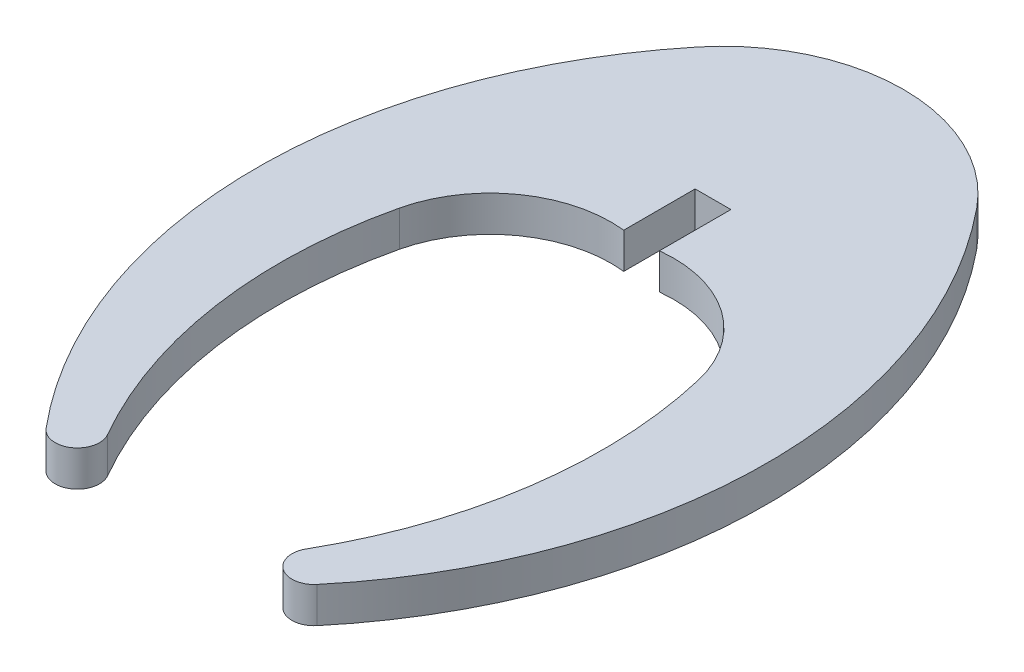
ISO-10303-21;
HEADER;
FILE_DESCRIPTION(('STEP AP214'),'2;1');
FILE_NAME('part.step','',(''),(''),'','','');
FILE_SCHEMA(('AUTOMOTIVE_DESIGN { 1 0 10303 214 1 1 1 1 }'));
ENDSEC;
DATA;
#1=APPLICATION_CONTEXT('core data for automotive mechanical design processes');
#2=APPLICATION_PROTOCOL_DEFINITION('international standard','automotive_design',2000,#1);
#3=PRODUCT_CONTEXT('',#1,'mechanical');
#4=PRODUCT('Part','Part','',(#3));
#5=PRODUCT_RELATED_PRODUCT_CATEGORY('part','',(#4));
#6=PRODUCT_DEFINITION_FORMATION('','',#4);
#7=PRODUCT_DEFINITION_CONTEXT('part definition',#1,'design');
#8=PRODUCT_DEFINITION('design','',#6,#7);
#9=PRODUCT_DEFINITION_SHAPE('','',#8);
#10=(LENGTH_UNIT() NAMED_UNIT(*) SI_UNIT(.MILLI.,.METRE.));
#11=(NAMED_UNIT(*) PLANE_ANGLE_UNIT() SI_UNIT($,.RADIAN.));
#12=(NAMED_UNIT(*) SI_UNIT($,.STERADIAN.) SOLID_ANGLE_UNIT());
#13=UNCERTAINTY_MEASURE_WITH_UNIT(LENGTH_MEASURE(1.E-05),#10,'distance_accuracy_value','');
#14=(GEOMETRIC_REPRESENTATION_CONTEXT(3) GLOBAL_UNCERTAINTY_ASSIGNED_CONTEXT((#13)) GLOBAL_UNIT_ASSIGNED_CONTEXT((#10,
#11,#12)) REPRESENTATION_CONTEXT('',''));
#15=CARTESIAN_POINT('',(0.,0.,0.));
#16=DIRECTION('',(0.,0.,1.));
#17=DIRECTION('',(1.,0.,0.));
#18=AXIS2_PLACEMENT_3D('',#15,#16,#17);
#19=CARTESIAN_POINT('',(-42034.834036,3.,-18212.047257));
#20=DIRECTION('',(0.999999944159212,0.,0.000334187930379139));
#21=DIRECTION('',(0.000334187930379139,0.,-0.999999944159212));
#22=AXIS2_PLACEMENT_3D('',#19,#20,#21);
#23=PLANE('',#22);
#24=DIRECTION('',(-0.000334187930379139,0.,0.999999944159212));
#25=VECTOR('',#24,1.);
#26=CARTESIAN_POINT('',(-42034.834036,0.,-18212.047257));
#27=LINE('',#26,#25);
#28=CARTESIAN_POINT('',(-42034.832031,0.,-18218.046875));
#29=VERTEX_POINT('',#28);
#30=CARTESIAN_POINT('',(-42034.834036,0.,-18212.047257));
#31=VERTEX_POINT('',#30);
#32=EDGE_CURVE('E156',#29,#31,#27,.T.);
#33=ORIENTED_EDGE('',*,*,#32,.T.);
#34=DIRECTION('',(0.,-1.,0.));
#35=VECTOR('',#34,1.);
#36=CARTESIAN_POINT('',(-42034.834036,3.,-18212.047257));
#37=LINE('',#36,#35);
#38=CARTESIAN_POINT('',(-42034.834036,3.,-18212.047257));
#39=VERTEX_POINT('',#38);
#40=EDGE_CURVE('E11',#39,#31,#37,.T.);
#41=ORIENTED_EDGE('',*,*,#40,.F.);
#42=DIRECTION('',(-0.000334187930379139,0.,0.999999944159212));
#43=VECTOR('',#42,1.);
#44=CARTESIAN_POINT('',(-42034.834036,3.,-18212.047257));
#45=LINE('',#44,#43);
#46=CARTESIAN_POINT('',(-42034.832031,3.,-18218.046875));
#47=VERTEX_POINT('',#46);
#48=EDGE_CURVE('E178',#47,#39,#45,.T.);
#49=ORIENTED_EDGE('',*,*,#48,.F.);
#50=DIRECTION('',(0.,-1.,0.));
#51=VECTOR('',#50,1.);
#52=CARTESIAN_POINT('',(-42034.832031,3.,-18218.046875));
#53=LINE('',#52,#51);
#54=EDGE_CURVE('E152',#47,#29,#53,.T.);
#55=ORIENTED_EDGE('',*,*,#54,.T.);
#56=EDGE_LOOP('',(#33,#41,#49,#55));
#57=FACE_BOUND('',#56,.T.);
#58=ADVANCED_FACE('F36',(#57),#23,.F.);
#59=CARTESIAN_POINT('',(-42033.6927198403,3.,-18201.9454393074));
#60=DIRECTION('',(0.,-1.,0.));
#61=DIRECTION('',(0.,0.,-1.));
#62=AXIS2_PLACEMENT_3D('',#59,#60,#61);
#63=CYLINDRICAL_SURFACE('',#62,10.1660869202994);
#64=CARTESIAN_POINT('',(-42033.6927198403,0.,-18201.9454393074));
#65=DIRECTION('',(0.,-1.,0.));
#66=DIRECTION('',(0.,0.,1.));
#67=AXIS2_PLACEMENT_3D('',#64,#65,#66);
#68=CIRCLE('',#67,10.1660869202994);
#69=CARTESIAN_POINT('',(-42023.795611,0.,-18204.268489));
#70=VERTEX_POINT('',#69);
#71=EDGE_CURVE('E159',#31,#70,#68,.T.);
#72=ORIENTED_EDGE('',*,*,#71,.T.);
#73=DIRECTION('',(0.,-1.,0.));
#74=VECTOR('',#73,1.);
#75=CARTESIAN_POINT('',(-42023.795611,3.,-18204.268489));
#76=LINE('',#75,#74);
#77=CARTESIAN_POINT('',(-42023.795611,3.,-18204.268489));
#78=VERTEX_POINT('',#77);
#79=EDGE_CURVE('E44',#78,#70,#76,.T.);
#80=ORIENTED_EDGE('',*,*,#79,.F.);
#81=CARTESIAN_POINT('',(-42033.6927198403,3.,-18201.9454393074));
#82=DIRECTION('',(0.,-1.,0.));
#83=DIRECTION('',(0.,0.,1.));
#84=AXIS2_PLACEMENT_3D('',#81,#82,#83);
#85=CIRCLE('',#84,10.1660869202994);
#86=EDGE_CURVE('E107',#39,#78,#85,.T.);
#87=ORIENTED_EDGE('',*,*,#86,.F.);
#88=ORIENTED_EDGE('',*,*,#40,.T.);
#89=EDGE_LOOP('',(#72,#80,#87,#88));
#90=FACE_BOUND('',#89,.T.);
#91=ADVANCED_FACE('F256',(#90),#63,.F.);
#92=CARTESIAN_POINT('',(-42062.3390260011,3.,-18195.2184921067));
#93=DIRECTION('',(0.,-1.,0.));
#94=DIRECTION('',(0.,0.,-1.));
#95=AXIS2_PLACEMENT_3D('',#92,#93,#94);
#96=CYLINDRICAL_SURFACE('',#95,39.5916314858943);
#97=CARTESIAN_POINT('',(-42062.3390260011,0.,-18195.2184921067));
#98=DIRECTION('',(0.,-1.,0.));
#99=DIRECTION('',(0.,0.,1.));
#100=AXIS2_PLACEMENT_3D('',#97,#98,#99);
#101=CIRCLE('',#100,39.5916314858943);
#102=CARTESIAN_POINT('',(-42027.9935790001,0.,-18175.523631));
#103=VERTEX_POINT('',#102);
#104=EDGE_CURVE('E161',#70,#103,#101,.T.);
#105=ORIENTED_EDGE('',*,*,#104,.T.);
#106=DIRECTION('',(0.,-1.,0.));
#107=VECTOR('',#106,1.);
#108=CARTESIAN_POINT('',(-42027.9935790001,3.,-18175.523631));
#109=LINE('',#108,#107);
#110=CARTESIAN_POINT('',(-42027.9935790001,3.,-18175.523631));
#111=VERTEX_POINT('',#110);
#112=EDGE_CURVE('E197',#111,#103,#109,.T.);
#113=ORIENTED_EDGE('',*,*,#112,.F.);
#114=CARTESIAN_POINT('',(-42062.3390260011,3.,-18195.2184921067));
#115=DIRECTION('',(0.,-1.,0.));
#116=DIRECTION('',(0.,0.,1.));
#117=AXIS2_PLACEMENT_3D('',#114,#115,#116);
#118=CIRCLE('',#117,39.5916314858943);
#119=EDGE_CURVE('E205',#78,#111,#118,.T.);
#120=ORIENTED_EDGE('',*,*,#119,.F.);
#121=ORIENTED_EDGE('',*,*,#79,.T.);
#122=EDGE_LOOP('',(#105,#113,#120,#121));
#123=FACE_BOUND('',#122,.T.);
#124=ADVANCED_FACE('F203',(#123),#96,.F.);
#125=CARTESIAN_POINT('',(-42026.3807247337,3.,-18174.6028281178));
#126=DIRECTION('',(0.,-1.,0.));
#127=DIRECTION('',(0.,0.,-1.));
#128=AXIS2_PLACEMENT_3D('',#125,#126,#127);
#129=CYLINDRICAL_SURFACE('',#128,1.85719595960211);
#130=CARTESIAN_POINT('',(-42026.3807247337,0.,-18174.6028281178));
#131=DIRECTION('',(0.,1.,0.));
#132=DIRECTION('',(0.,0.,1.));
#133=AXIS2_PLACEMENT_3D('',#130,#131,#132);
#134=CIRCLE('',#133,1.85719595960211);
#135=CARTESIAN_POINT('',(-42024.957301,0.,-18173.4099149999));
#136=VERTEX_POINT('',#135);
#137=EDGE_CURVE('E163',#103,#136,#134,.T.);
#138=ORIENTED_EDGE('',*,*,#137,.T.);
#139=DIRECTION('',(0.,-1.,0.));
#140=VECTOR('',#139,1.);
#141=CARTESIAN_POINT('',(-42024.957301,3.,-18173.4099149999));
#142=LINE('',#141,#140);
#143=CARTESIAN_POINT('',(-42024.957301,3.,-18173.4099149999));
#144=VERTEX_POINT('',#143);
#145=EDGE_CURVE('E194',#144,#136,#142,.T.);
#146=ORIENTED_EDGE('',*,*,#145,.F.);
#147=CARTESIAN_POINT('',(-42026.3807247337,3.,-18174.6028281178));
#148=DIRECTION('',(0.,1.,0.));
#149=DIRECTION('',(0.,0.,1.));
#150=AXIS2_PLACEMENT_3D('',#147,#148,#149);
#151=CIRCLE('',#150,1.85719595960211);
#152=EDGE_CURVE('E223',#111,#144,#151,.T.);
#153=ORIENTED_EDGE('',*,*,#152,.F.);
#154=ORIENTED_EDGE('',*,*,#112,.T.);
#155=EDGE_LOOP('',(#138,#146,#153,#154));
#156=FACE_BOUND('',#155,.T.);
#157=ADVANCED_FACE('F214',(#156),#129,.T.);
#158=CARTESIAN_POINT('',(-42058.0976320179,3.,-18201.1444438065));
#159=DIRECTION('',(0.,-1.,0.));
#160=DIRECTION('',(0.,0.,-1.));
#161=AXIS2_PLACEMENT_3D('',#158,#159,#160);
#162=CYLINDRICAL_SURFACE('',#161,43.2144145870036);
#163=CARTESIAN_POINT('',(-42058.0976320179,0.,-18201.1444438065));
#164=DIRECTION('',(0.,1.,0.));
#165=DIRECTION('',(0.,0.,1.));
#166=AXIS2_PLACEMENT_3D('',#163,#164,#165);
#167=CIRCLE('',#166,43.2144145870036);
#168=CARTESIAN_POINT('',(-42024.611583,0.,-18228.460559));
#169=VERTEX_POINT('',#168);
#170=EDGE_CURVE('E165',#136,#169,#167,.T.);
#171=ORIENTED_EDGE('',*,*,#170,.T.);
#172=DIRECTION('',(0.,-1.,0.));
#173=VECTOR('',#172,1.);
#174=CARTESIAN_POINT('',(-42024.611583,3.,-18228.460559));
#175=LINE('',#174,#173);
#176=CARTESIAN_POINT('',(-42024.611583,3.,-18228.460559));
#177=VERTEX_POINT('',#176);
#178=EDGE_CURVE('E191',#177,#169,#175,.T.);
#179=ORIENTED_EDGE('',*,*,#178,.F.);
#180=CARTESIAN_POINT('',(-42058.0976320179,3.,-18201.1444438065));
#181=DIRECTION('',(0.,1.,0.));
#182=DIRECTION('',(0.,0.,1.));
#183=AXIS2_PLACEMENT_3D('',#180,#181,#182);
#184=CIRCLE('',#183,43.2144145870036);
#185=EDGE_CURVE('E220',#144,#177,#184,.T.);
#186=ORIENTED_EDGE('',*,*,#185,.F.);
#187=ORIENTED_EDGE('',*,*,#145,.T.);
#188=EDGE_LOOP('',(#171,#179,#186,#187));
#189=FACE_BOUND('',#188,.T.);
#190=ADVANCED_FACE('F218',(#189),#162,.T.);
#191=CARTESIAN_POINT('',(-42036.3337421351,3.,-18218.8945302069));
#192=DIRECTION('',(0.,-1.,0.));
#193=DIRECTION('',(0.,0.,-1.));
#194=AXIS2_PLACEMENT_3D('',#191,#192,#193);
#195=CYLINDRICAL_SURFACE('',#194,15.1300337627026);
#196=CARTESIAN_POINT('',(-42036.3337421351,0.,-18218.8945302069));
#197=DIRECTION('',(0.,1.,0.));
#198=DIRECTION('',(0.,0.,1.));
#199=AXIS2_PLACEMENT_3D('',#196,#197,#198);
#200=CIRCLE('',#199,15.1300337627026);
#201=CARTESIAN_POINT('',(-42048.064893,0.,-18228.44953));
#202=VERTEX_POINT('',#201);
#203=EDGE_CURVE('E167',#169,#202,#200,.T.);
#204=ORIENTED_EDGE('',*,*,#203,.T.);
#205=DIRECTION('',(0.,-1.,0.));
#206=VECTOR('',#205,1.);
#207=CARTESIAN_POINT('',(-42048.064893,3.,-18228.44953));
#208=LINE('',#207,#206);
#209=CARTESIAN_POINT('',(-42048.064893,3.,-18228.44953));
#210=VERTEX_POINT('',#209);
#211=EDGE_CURVE('E188',#210,#202,#208,.T.);
#212=ORIENTED_EDGE('',*,*,#211,.F.);
#213=CARTESIAN_POINT('',(-42036.3337421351,3.,-18218.8945302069));
#214=DIRECTION('',(0.,1.,0.));
#215=DIRECTION('',(0.,0.,1.));
#216=AXIS2_PLACEMENT_3D('',#213,#214,#215);
#217=CIRCLE('',#216,15.1300337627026);
#218=EDGE_CURVE('E222',#177,#210,#217,.T.);
#219=ORIENTED_EDGE('',*,*,#218,.F.);
#220=ORIENTED_EDGE('',*,*,#178,.T.);
#221=EDGE_LOOP('',(#204,#212,#219,#220));
#222=FACE_BOUND('',#221,.T.);
#223=ADVANCED_FACE('F269',(#222),#195,.T.);
#224=CARTESIAN_POINT('',(-42014.5585744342,3.,-18201.1593485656));
#225=DIRECTION('',(0.,-1.,0.));
#226=DIRECTION('',(0.,0.,-1.));
#227=AXIS2_PLACEMENT_3D('',#224,#225,#226);
#228=CYLINDRICAL_SURFACE('',#227,43.2137407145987);
#229=CARTESIAN_POINT('',(-42014.5585744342,0.,-18201.1593485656));
#230=DIRECTION('',(0.,1.,0.));
#231=DIRECTION('',(0.,0.,1.));
#232=AXIS2_PLACEMENT_3D('',#229,#230,#231);
#233=CIRCLE('',#232,43.2137407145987);
#234=CARTESIAN_POINT('',(-42047.6746850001,0.,-18173.3969530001));
#235=VERTEX_POINT('',#234);
#236=EDGE_CURVE('E169',#202,#235,#233,.T.);
#237=ORIENTED_EDGE('',*,*,#236,.T.);
#238=DIRECTION('',(0.,-1.,0.));
#239=VECTOR('',#238,1.);
#240=CARTESIAN_POINT('',(-42047.6746850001,3.,-18173.3969530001));
#241=LINE('',#240,#239);
#242=CARTESIAN_POINT('',(-42047.6746850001,3.,-18173.3969530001));
#243=VERTEX_POINT('',#242);
#244=EDGE_CURVE('E185',#243,#235,#241,.T.);
#245=ORIENTED_EDGE('',*,*,#244,.F.);
#246=CARTESIAN_POINT('',(-42014.5585744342,3.,-18201.1593485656));
#247=DIRECTION('',(0.,1.,0.));
#248=DIRECTION('',(0.,0.,1.));
#249=AXIS2_PLACEMENT_3D('',#246,#247,#248);
#250=CIRCLE('',#249,43.2137407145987);
#251=EDGE_CURVE('E225',#210,#243,#250,.T.);
#252=ORIENTED_EDGE('',*,*,#251,.F.);
#253=ORIENTED_EDGE('',*,*,#211,.T.);
#254=EDGE_LOOP('',(#237,#245,#252,#253));
#255=FACE_BOUND('',#254,.T.);
#256=ADVANCED_FACE('F272',(#255),#228,.T.);
#257=CARTESIAN_POINT('',(-42046.2492862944,3.,-18174.5922949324));
#258=DIRECTION('',(0.,-1.,0.));
#259=DIRECTION('',(0.,0.,-1.));
#260=AXIS2_PLACEMENT_3D('',#257,#258,#259);
#261=CYLINDRICAL_SURFACE('',#260,1.86026982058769);
#262=CARTESIAN_POINT('',(-42046.2492862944,0.,-18174.5922949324));
#263=DIRECTION('',(0.,1.,0.));
#264=DIRECTION('',(0.,0.,1.));
#265=AXIS2_PLACEMENT_3D('',#262,#263,#264);
#266=CIRCLE('',#265,1.86026982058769);
#267=CARTESIAN_POINT('',(-42044.635357,0.,-18175.517409));
#268=VERTEX_POINT('',#267);
#269=EDGE_CURVE('E171',#235,#268,#266,.T.);
#270=ORIENTED_EDGE('',*,*,#269,.T.);
#271=DIRECTION('',(0.,-1.,0.));
#272=VECTOR('',#271,1.);
#273=CARTESIAN_POINT('',(-42044.635357,3.,-18175.517409));
#274=LINE('',#273,#272);
#275=CARTESIAN_POINT('',(-42044.635357,3.,-18175.517409));
#276=VERTEX_POINT('',#275);
#277=EDGE_CURVE('E182',#276,#268,#274,.T.);
#278=ORIENTED_EDGE('',*,*,#277,.F.);
#279=CARTESIAN_POINT('',(-42046.2492862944,3.,-18174.5922949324));
#280=DIRECTION('',(0.,1.,0.));
#281=DIRECTION('',(0.,0.,1.));
#282=AXIS2_PLACEMENT_3D('',#279,#280,#281);
#283=CIRCLE('',#282,1.86026982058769);
#284=EDGE_CURVE('E231',#243,#276,#283,.T.);
#285=ORIENTED_EDGE('',*,*,#284,.F.);
#286=ORIENTED_EDGE('',*,*,#244,.T.);
#287=EDGE_LOOP('',(#270,#278,#285,#286));
#288=FACE_BOUND('',#287,.T.);
#289=ADVANCED_FACE('F237',(#288),#261,.T.);
#290=CARTESIAN_POINT('',(-42010.3038584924,3.,-18195.2365428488));
#291=DIRECTION('',(0.,-1.,0.));
#292=DIRECTION('',(0.,0.,-1.));
#293=AXIS2_PLACEMENT_3D('',#290,#291,#292);
#294=CYLINDRICAL_SURFACE('',#293,39.5916156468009);
#295=CARTESIAN_POINT('',(-42010.3038584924,0.,-18195.2365428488));
#296=DIRECTION('',(0.,-1.,0.));
#297=DIRECTION('',(0.,0.,1.));
#298=AXIS2_PLACEMENT_3D('',#295,#296,#297);
#299=CIRCLE('',#298,39.5916156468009);
#300=CARTESIAN_POINT('',(-42048.854104,0.,-18204.25733));
#301=VERTEX_POINT('',#300);
#302=EDGE_CURVE('E173',#268,#301,#299,.T.);
#303=ORIENTED_EDGE('',*,*,#302,.T.);
#304=DIRECTION('',(0.,-1.,0.));
#305=VECTOR('',#304,1.);
#306=CARTESIAN_POINT('',(-42048.854104,3.,-18204.25733));
#307=LINE('',#306,#305);
#308=CARTESIAN_POINT('',(-42048.854104,3.,-18204.25733));
#309=VERTEX_POINT('',#308);
#310=EDGE_CURVE('E147',#309,#301,#307,.T.);
#311=ORIENTED_EDGE('',*,*,#310,.F.);
#312=CARTESIAN_POINT('',(-42010.3038584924,3.,-18195.2365428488));
#313=DIRECTION('',(0.,-1.,0.));
#314=DIRECTION('',(0.,0.,1.));
#315=AXIS2_PLACEMENT_3D('',#312,#313,#314);
#316=CIRCLE('',#315,39.5916156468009);
#317=EDGE_CURVE('E138',#276,#309,#316,.T.);
#318=ORIENTED_EDGE('',*,*,#317,.F.);
#319=ORIENTED_EDGE('',*,*,#277,.T.);
#320=EDGE_LOOP('',(#303,#311,#318,#319));
#321=FACE_BOUND('',#320,.T.);
#322=ADVANCED_FACE('F241',(#321),#294,.F.);
#323=CARTESIAN_POINT('',(-42038.954622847,3.,-18201.945061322));
#324=DIRECTION('',(0.,-1.,0.));
#325=DIRECTION('',(0.,0.,-1.));
#326=AXIS2_PLACEMENT_3D('',#323,#324,#325);
#327=CYLINDRICAL_SURFACE('',#326,10.1659388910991);
#328=CARTESIAN_POINT('',(-42038.954622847,0.,-18201.945061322));
#329=DIRECTION('',(0.,-1.,0.));
#330=DIRECTION('',(0.,0.,1.));
#331=AXIS2_PLACEMENT_3D('',#328,#329,#330);
#332=CIRCLE('',#331,10.1659388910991);
#333=CARTESIAN_POINT('',(-42037.832031,0.,-18212.048828));
#334=VERTEX_POINT('',#333);
#335=EDGE_CURVE('E146',#301,#334,#332,.T.);
#336=ORIENTED_EDGE('',*,*,#335,.T.);
#337=DIRECTION('',(0.,-1.,0.));
#338=VECTOR('',#337,1.);
#339=CARTESIAN_POINT('',(-42037.832031,3.,-18212.048828));
#340=LINE('',#339,#338);
#341=CARTESIAN_POINT('',(-42037.832031,3.,-18212.048828));
#342=VERTEX_POINT('',#341);
#343=EDGE_CURVE('E143',#342,#334,#340,.T.);
#344=ORIENTED_EDGE('',*,*,#343,.F.);
#345=CARTESIAN_POINT('',(-42038.954622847,3.,-18201.945061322));
#346=DIRECTION('',(0.,-1.,0.));
#347=DIRECTION('',(0.,0.,1.));
#348=AXIS2_PLACEMENT_3D('',#345,#346,#347);
#349=CIRCLE('',#348,10.1659388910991);
#350=EDGE_CURVE('E132',#309,#342,#349,.T.);
#351=ORIENTED_EDGE('',*,*,#350,.F.);
#352=ORIENTED_EDGE('',*,*,#310,.T.);
#353=EDGE_LOOP('',(#336,#344,#351,#352));
#354=FACE_BOUND('',#353,.T.);
#355=ADVANCED_FACE('F144',(#354),#327,.F.);
#356=CARTESIAN_POINT('',(-42037.835937,3.,-18218.044922));
#357=DIRECTION('',(-0.999999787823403,0.,0.000651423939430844));
#358=DIRECTION('',(0.000651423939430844,0.,0.999999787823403));
#359=AXIS2_PLACEMENT_3D('',#356,#357,#358);
#360=PLANE('',#359);
#361=DIRECTION('',(-0.000651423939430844,0.,-0.999999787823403));
#362=VECTOR('',#361,1.);
#363=CARTESIAN_POINT('',(-42037.835937,0.,-18218.044922));
#364=LINE('',#363,#362);
#365=CARTESIAN_POINT('',(-42037.835937,0.,-18218.044922));
#366=VERTEX_POINT('',#365);
#367=EDGE_CURVE('E93',#334,#366,#364,.T.);
#368=ORIENTED_EDGE('',*,*,#367,.T.);
#369=DIRECTION('',(0.,-1.,0.));
#370=VECTOR('',#369,1.);
#371=CARTESIAN_POINT('',(-42037.835937,3.,-18218.044922));
#372=LINE('',#371,#370);
#373=CARTESIAN_POINT('',(-42037.835937,3.,-18218.044922));
#374=VERTEX_POINT('',#373);
#375=EDGE_CURVE('E148',#374,#366,#372,.T.);
#376=ORIENTED_EDGE('',*,*,#375,.F.);
#377=DIRECTION('',(-0.000651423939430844,0.,-0.999999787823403));
#378=VECTOR('',#377,1.);
#379=CARTESIAN_POINT('',(-42037.835937,3.,-18218.044922));
#380=LINE('',#379,#378);
#381=EDGE_CURVE('E136',#342,#374,#380,.T.);
#382=ORIENTED_EDGE('',*,*,#381,.F.);
#383=ORIENTED_EDGE('',*,*,#343,.T.);
#384=EDGE_LOOP('',(#368,#376,#382,#383));
#385=FACE_BOUND('',#384,.T.);
#386=ADVANCED_FACE('F150',(#385),#360,.F.);
#387=CARTESIAN_POINT('',(-42034.832031,3.,-18218.046875));
#388=DIRECTION('',(-0.000650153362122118,0.,-0.999999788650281));
#389=DIRECTION('',(-0.999999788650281,0.,0.000650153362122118));
#390=AXIS2_PLACEMENT_3D('',#387,#388,#389);
#391=PLANE('',#390);
#392=DIRECTION('',(0.99999978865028,0.,-0.000650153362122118));
#393=VECTOR('',#392,1.);
#394=CARTESIAN_POINT('',(-42034.832031,0.,-18218.046875));
#395=LINE('',#394,#393);
#396=EDGE_CURVE('E99',#366,#29,#395,.T.);
#397=ORIENTED_EDGE('',*,*,#396,.T.);
#398=ORIENTED_EDGE('',*,*,#54,.F.);
#399=DIRECTION('',(0.99999978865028,0.,-0.000650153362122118));
#400=VECTOR('',#399,1.);
#401=CARTESIAN_POINT('',(-42034.832031,3.,-18218.046875));
#402=LINE('',#401,#400);
#403=EDGE_CURVE('E52',#374,#47,#402,.T.);
#404=ORIENTED_EDGE('',*,*,#403,.F.);
#405=ORIENTED_EDGE('',*,*,#375,.T.);
#406=EDGE_LOOP('',(#397,#398,#404,#405));
#407=FACE_BOUND('',#406,.T.);
#408=ADVANCED_FACE('F245',(#407),#391,.F.);
#409=CARTESIAN_POINT('',(-42038.954622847,3.,-18201.945061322));
#410=DIRECTION('',(0.,1.,0.));
#411=DIRECTION('',(0.,0.,1.));
#412=AXIS2_PLACEMENT_3D('',#409,#410,#411);
#413=PLANE('',#412);
#414=ORIENTED_EDGE('',*,*,#48,.T.);
#415=ORIENTED_EDGE('',*,*,#86,.T.);
#416=ORIENTED_EDGE('',*,*,#119,.T.);
#417=ORIENTED_EDGE('',*,*,#152,.T.);
#418=ORIENTED_EDGE('',*,*,#185,.T.);
#419=ORIENTED_EDGE('',*,*,#218,.T.);
#420=ORIENTED_EDGE('',*,*,#251,.T.);
#421=ORIENTED_EDGE('',*,*,#284,.T.);
#422=ORIENTED_EDGE('',*,*,#317,.T.);
#423=ORIENTED_EDGE('',*,*,#350,.T.);
#424=ORIENTED_EDGE('',*,*,#381,.T.);
#425=ORIENTED_EDGE('',*,*,#403,.T.);
#426=EDGE_LOOP('',(#414,#415,#416,#417,#418,#419,#420,#421,#422,#423,#424,#425));
#427=FACE_BOUND('',#426,.T.);
#428=ADVANCED_FACE('F134',(#427),#413,.T.);
#429=CARTESIAN_POINT('',(-42038.954622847,0.,-18201.945061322));
#430=DIRECTION('',(0.,1.,0.));
#431=DIRECTION('',(0.,0.,1.));
#432=AXIS2_PLACEMENT_3D('',#429,#430,#431);
#433=PLANE('',#432);
#434=ORIENTED_EDGE('',*,*,#32,.F.);
#435=ORIENTED_EDGE('',*,*,#396,.F.);
#436=ORIENTED_EDGE('',*,*,#367,.F.);
#437=ORIENTED_EDGE('',*,*,#335,.F.);
#438=ORIENTED_EDGE('',*,*,#302,.F.);
#439=ORIENTED_EDGE('',*,*,#269,.F.);
#440=ORIENTED_EDGE('',*,*,#236,.F.);
#441=ORIENTED_EDGE('',*,*,#203,.F.);
#442=ORIENTED_EDGE('',*,*,#170,.F.);
#443=ORIENTED_EDGE('',*,*,#137,.F.);
#444=ORIENTED_EDGE('',*,*,#104,.F.);
#445=ORIENTED_EDGE('',*,*,#71,.F.);
#446=EDGE_LOOP('',(#434,#435,#436,#437,#438,#439,#440,#441,#442,#443,#444,#445));
#447=FACE_BOUND('',#446,.T.);
#448=ADVANCED_FACE('F209',(#447),#433,.F.);
#449=CLOSED_SHELL('',(#58,#91,#124,#157,#190,#223,#256,#289,#322,#355,#386,#408,#428,#448));
#450=MANIFOLD_SOLID_BREP('B2',#449);
#451=ADVANCED_BREP_SHAPE_REPRESENTATION('',(#18,#450),#14);
#452=SHAPE_DEFINITION_REPRESENTATION(#9,#451);
ENDSEC;
END-ISO-10303-21;
